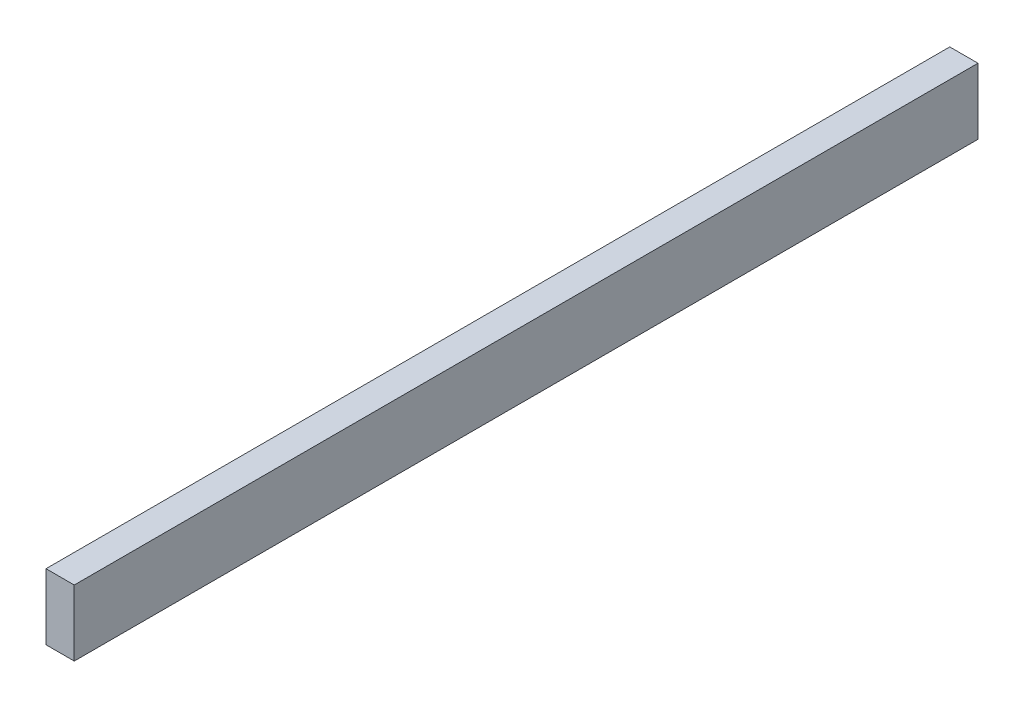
from build123d import *

# Parameters (mm, degrees)
SKETCH1_W           = 38.1
SKETCH1_H           = 88.9
BOSS_EXTRUDE1_DEPTH = 1219.2


with BuildPart() as part:
    # Sketch1 → Boss-Extrude1 (new body)
    with BuildSketch(Plane.XY):
        Rectangle(SKETCH1_W, SKETCH1_H)
    extrude(amount=BOSS_EXTRUDE1_DEPTH)


solid = part.part
